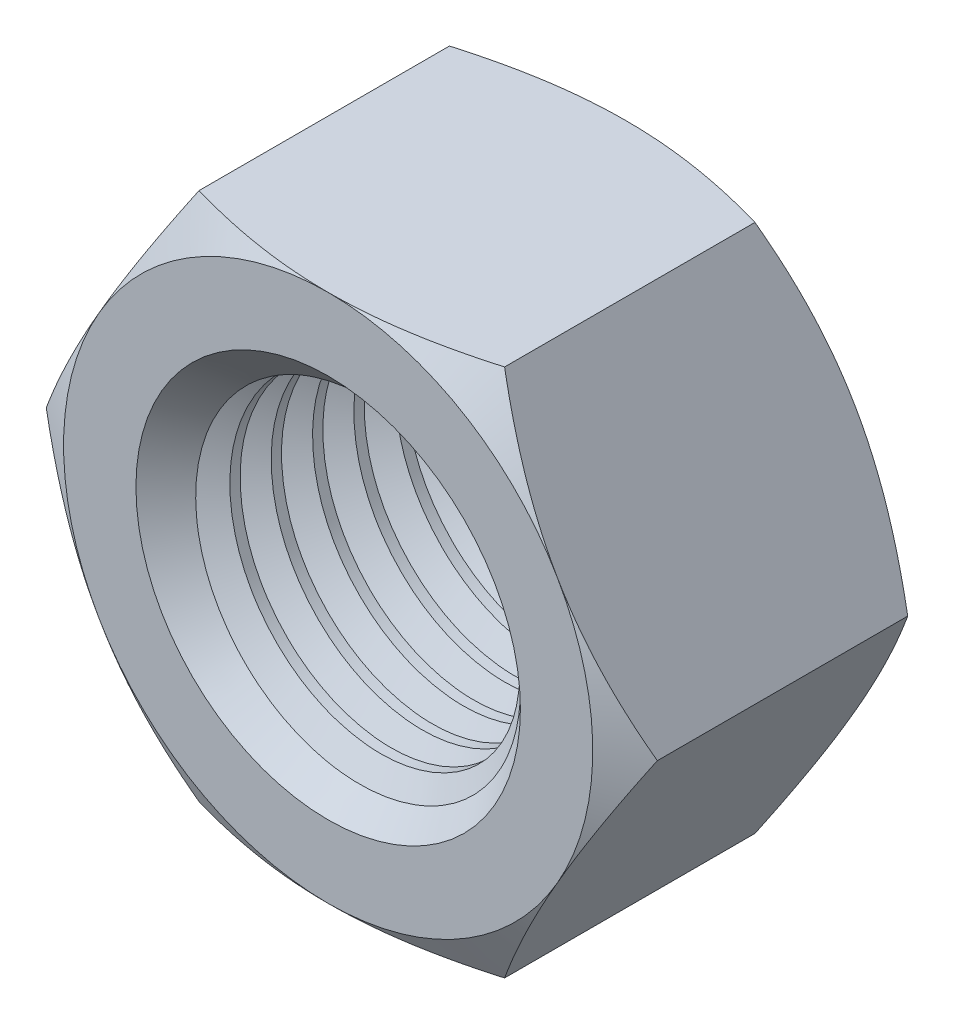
from build123d import *

# Parameters (mm, degrees)
Y_KSEKLIK_EKSTR_ZYON1_DEPTH = 18
IZIM3_OUTSIDE_W             = 111.722
IZIM3_OUTSIDE_H             = 106.772
IZIM3_OUTSIDE_R             = 16
KES_EKSTR_ZYON1_DEPTH       = 18
KES_EKSTR_ZYON1_DRAFT       = -60
IZIM4_OUTSIDE_W             = 111.722
IZIM4_OUTSIDE_H             = 106.772
IZIM4_OUTSIDE_R             = 16
KES_EKSTR_ZYON2_DEPTH       = 18
KES_EKSTR_ZYON2_DRAFT       = -60
IZIM5_R                     = 9.375
KES_EKSTR_ZYON3_DEPTH       = 18
PAH1_SIZE                   = 2.25
KES_S_P_R1_PITCH            = 2.5
KES_S_P_R1_HEIGHT           = 22
KES_S_P_R1_RADIUS           = 9.375


with BuildPart() as part:
    # izim2 → Y_kseklik-Ekstr_zyon1 (new body)
    with BuildSketch(Plane.XY):
        Polygon((18.475208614, 0), (9.237604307, 16), (-9.237604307, 16), (-18.475208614, 0), (-9.237604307, -16), (9.237604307, -16), align=None)
    extrude(amount=Y_KSEKLIK_EKSTR_ZYON1_DEPTH)


with BuildPart() as kes_ekstr_zyon1_tool:
    # izim3 outside → Kes-Ekstr_zyon1 (with draft: the straight prism first)
    with BuildSketch(Plane.XY.offset(18)):
        Rectangle(IZIM3_OUTSIDE_W, IZIM3_OUTSIDE_H)
        Circle(IZIM3_OUTSIDE_R, mode=Mode.SUBTRACT)
    extrude(amount=-KES_EKSTR_ZYON1_DEPTH)
    # Kes-Ekstr_zyon1: the draft: its side faces are tilted about the plane it starts from
    kes_ekstr_zyon1_sides = [kes_ekstr_zyon1_tool.faces().sort_by_distance(p)[0] for p in [
        (0, -53.386, 9),
        (55.861, 0, 9),
        (0, 53.386, 9),
        (-55.861, 0, 9),
        (-16, 0, 9),
    ]]
    draft(kes_ekstr_zyon1_sides, Plane.XY.offset(18), KES_EKSTR_ZYON1_DRAFT)


with BuildPart() as part_1:
    add(part.part)

    # Kes-Ekstr_zyon1: cut by kes_ekstr_zyon1_tool
    add(kes_ekstr_zyon1_tool.part, mode=Mode.SUBTRACT)


with BuildPart() as kes_ekstr_zyon2_tool:
    # izim4 outside → Kes-Ekstr_zyon2 (with draft: the straight prism first)
    with BuildSketch(Plane(origin=(0, 0, 0), x_dir=(-1, 0, 0), z_dir=(0, 0, -1))):
        Rectangle(IZIM4_OUTSIDE_W, IZIM4_OUTSIDE_H)
        Circle(IZIM4_OUTSIDE_R, mode=Mode.SUBTRACT)
    extrude(amount=-KES_EKSTR_ZYON2_DEPTH)
    # Kes-Ekstr_zyon2: the draft: its side faces are tilted about the plane it starts from
    kes_ekstr_zyon2_sides = [kes_ekstr_zyon2_tool.faces().sort_by_distance(p)[0] for p in [
        (0, -53.386, 9),
        (-55.861, 0, 9),
        (0, 53.386, 9),
        (55.861, 0, 9),
        (16, 0, 9),
    ]]
    draft(kes_ekstr_zyon2_sides, Plane(origin=(0, 0, 0), x_dir=(-1, 0, 0), z_dir=(0, 0, -1)), KES_EKSTR_ZYON2_DRAFT)


with BuildPart() as part_2:
    add(part_1.part)

    # Kes-Ekstr_zyon2: cut by kes_ekstr_zyon2_tool
    add(kes_ekstr_zyon2_tool.part, mode=Mode.SUBTRACT)

    # izim5 → Kes-Ekstr_zyon3 (cut)
    with BuildSketch(Plane(origin=(0, 0, 0), x_dir=(-1, 0, 0), z_dir=(0, 0, -1))):
        Circle(IZIM5_R)
    extrude(amount=-KES_EKSTR_ZYON3_DEPTH, mode=Mode.SUBTRACT)

    # Pah1
    pah1_edges = [part_2.edges().sort_by_distance(p)[0] for p in [
        (9.375, 0, 18),
        (9.375, 0, 0),
    ]]
    chamfer(pah1_edges, length=PAH1_SIZE)

    # Kes-S_p_r1: sweep along a helix
    with BuildLine() as kes_s_p_r1_path:
        Helix(KES_S_P_R1_PITCH, KES_S_P_R1_HEIGHT, KES_S_P_R1_RADIUS, center=(0, 0, 18), direction=(0, 0, -1))
    # izim7 → Kes-S_p_r1 (sweep, cut)
    with BuildSketch(Plane(origin=(-2.897034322, -8.91615484, -4), x_dir=(-0.04032778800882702, 0.013103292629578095, 0.9991005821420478), z_dir=(-0.9502011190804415, 0.3087390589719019, -0.04240314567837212))):
        Polygon((1.229291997, 0.504196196), (-1.229291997, 0.504196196), (0, -1.625), align=None)
    sweep(path=kes_s_p_r1_path.line, is_frenet=True, mode=Mode.SUBTRACT)


solid = part_2.part
